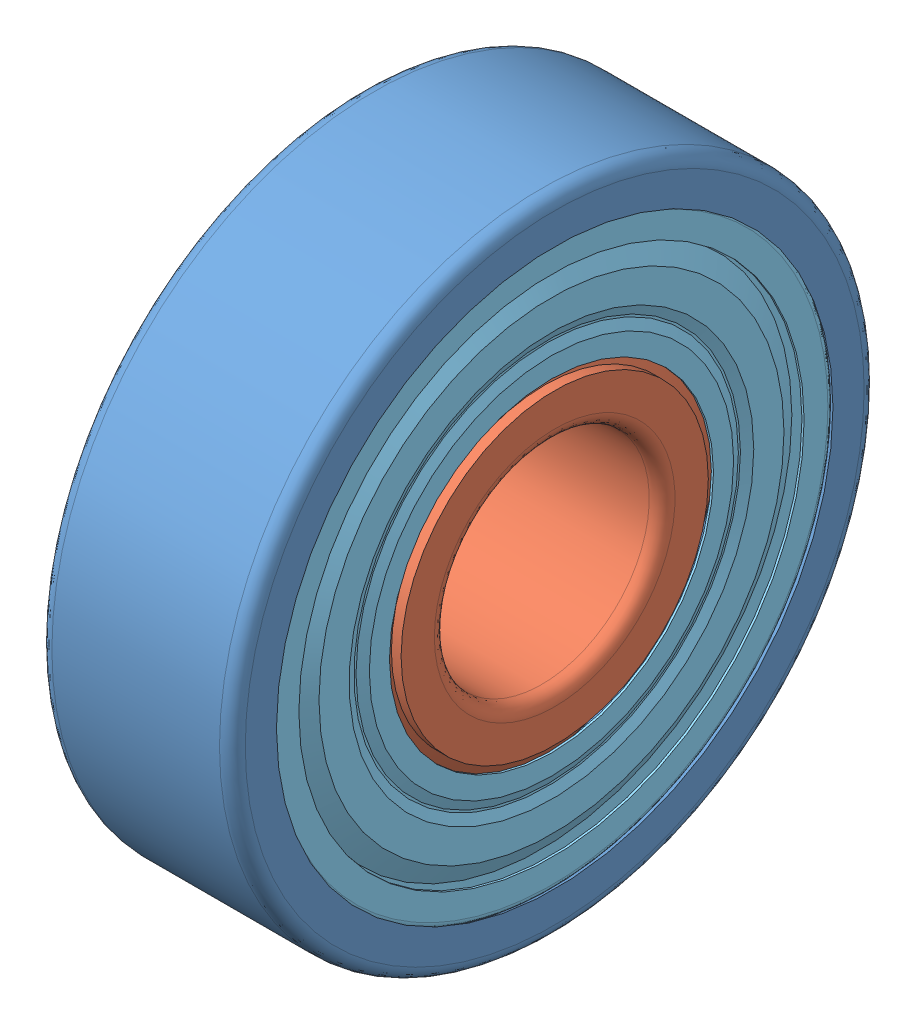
SolidWorks assembly 6200zz.SLDASM, configuration Default (file format 6000). Lengths in mm.
Overall size (9 30 30).
5 component instances, 5 part files, 0 mates.
Components (placement in the parent):
- 6200zz_01-1: 6200zz_01.SLDPRT [Default] at origin size (9 30 30)
- 6200zz_02-1: 6200zz_02.SLDPRT [Default] at origin size (9 18.32 18.32)
- 6200zz_03-1: 6200zz_03.SLDPRT [Default] at origin size (5.6 25.6 25.6)
- 6200zz_04-1: 6200zz_04.SLDPRT [Default] at origin size (0.6 26.33 26.33)
- 6200zz_05-1: 6200zz_05.SLDPRT [Default] at origin size (0.6 26.33 26.33)
